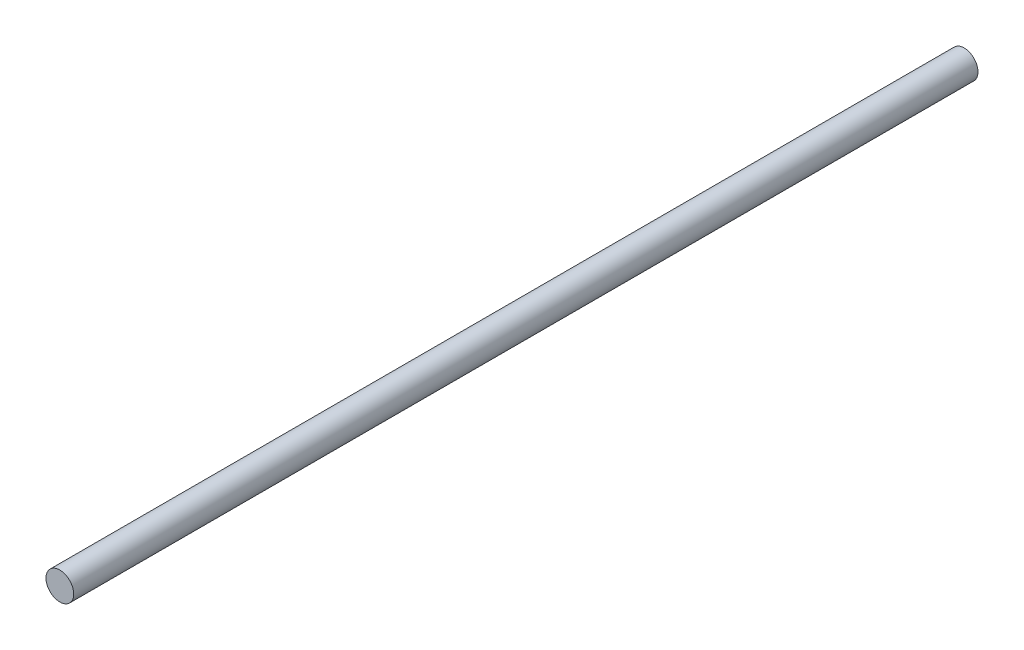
from build123d import *

# Parameters (mm, degrees)
ESQUISSE1_R      = 9.96173699
EXTRUSION1_DEPTH = 325


with BuildPart() as part:
    # Esquisse1 → Extrusion1 (new, symmetric)
    with BuildSketch(Plane.XY):
        Circle(ESQUISSE1_R)
    extrude(amount=EXTRUSION1_DEPTH, both=True)


solid = part.part
